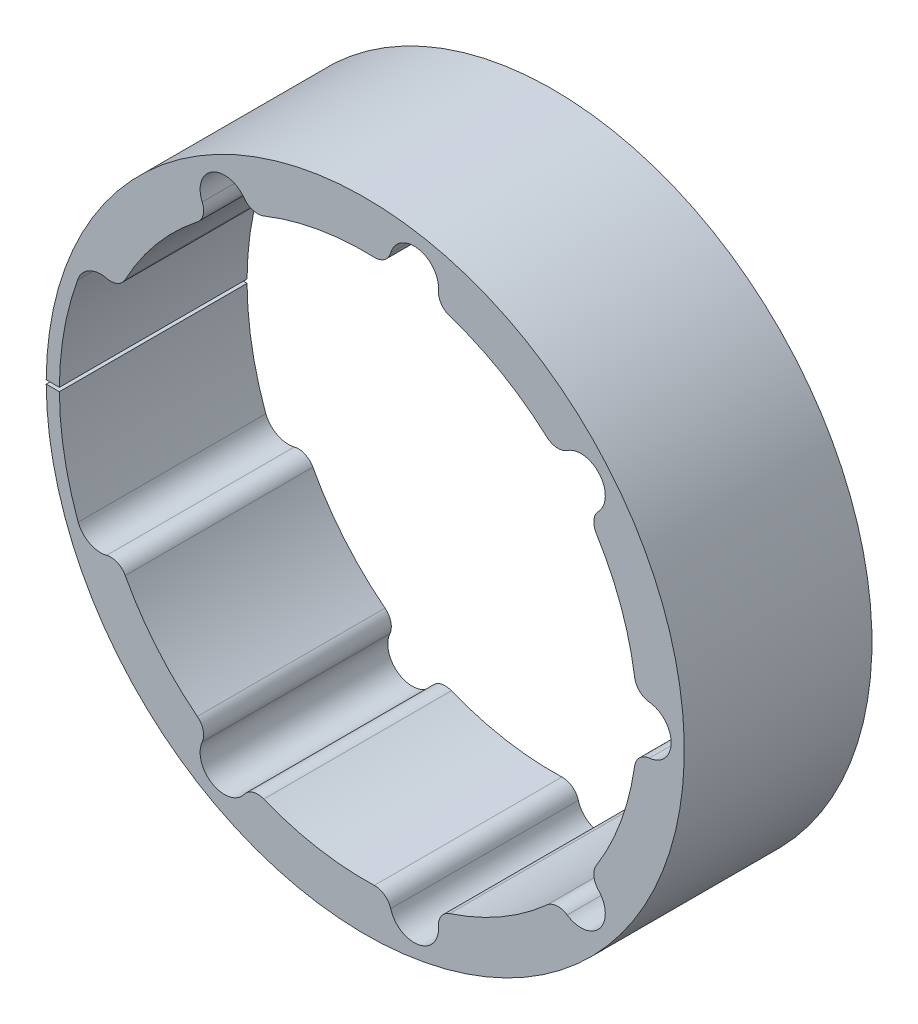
from build123d import *

# Parameters (mm, degrees)
BOSS_EXTRUDE1_DEPTH = 25
FILLET1_R           = 2.2


with BuildPart() as part:
    # Sketch1 → Boss-Extrude1 (new body)
    with BuildSketch(Plane.XY):
        with BuildLine():
            Line((36.104016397, 3.25), (37.5, 3.25))
            ThreePointArc((37.5, 3.25), (40.75, 0), (37.5, -3.25))
            Line((37.5, -3.25), (36.104016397, -3.25))
            ThreePointArc((36.104016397, -3.25), (34.063857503, -12.398230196), (29.746340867, -20.71756996))
            Line((29.746340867, -20.71756996), (30.815726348, -21.614890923))
            ThreePointArc((30.815726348, -21.614890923), (31.216311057, -26.193595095), (26.637606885, -26.594179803))
            Line((26.637606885, -26.594179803), (25.568221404, -25.69685884))
            ThreePointArc((25.568221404, -25.69685884), (18.125, -31.393420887), (9.470021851, -34.991158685))
            Line((9.470021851, -34.991158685), (9.71243186, -36.365934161))
            ThreePointArc((9.71243186, -36.365934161), (7.07616324, -40.130915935), (3.311181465, -37.494647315))
            Line((3.311181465, -37.494647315), (3.068771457, -36.11987184))
            ThreePointArc((3.068771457, -36.11987184), (-6.29474644, -35.699281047), (-15.237425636, -32.891995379))
            Line((-15.237425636, -32.891995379), (-15.935417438, -34.100952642))
            ThreePointArc((-15.935417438, -34.100952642), (-20.375, -35.290535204), (-21.564582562, -30.850952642))
            Line((-21.564582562, -30.850952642), (-20.866590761, -29.641995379))
            ThreePointArc((-20.866590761, -29.641995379), (-27.769111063, -23.301050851), (-32.815112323, -15.40230188))
            Line((-32.815112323, -15.40230188), (-34.126907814, -15.879756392))
            ThreePointArc((-34.126907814, -15.879756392), (-36.554264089, -15.797487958), (-38.246792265, -14.055599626))
            ThreePointArc((-38.246792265, -14.055599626), (-40.095532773, -7.261215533), (-40.746956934, -0.25))
            Line((-40.746956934, -0.25), (-42.4992647, -0.25))
            ThreePointArc((-42.4992647, -0.25), (0.125000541, -42.499816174), (42.5, 0))
            ThreePointArc((42.5, 0), (0.125000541, 42.499816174), (-42.4992647, 0.25))
            Line((-42.4992647, 0.25), (-40.746956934, 0.25))
            ThreePointArc((-40.746956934, 0.25), (-40.117929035, 7.136439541), (-38.333507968, 13.81735019))
            ThreePointArc((-38.333507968, 13.81735019), (-36.669178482, 15.743902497), (-34.126907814, 15.879756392))
            Line((-34.126907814, 15.879756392), (-32.815112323, 15.40230188))
            ThreePointArc((-32.815112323, 15.40230188), (-27.769111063, 23.301050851), (-20.866590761, 29.641995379))
            Line((-20.866590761, 29.641995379), (-21.564582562, 30.850952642))
            ThreePointArc((-21.564582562, 30.850952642), (-20.375, 35.290535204), (-15.935417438, 34.100952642))
            Line((-15.935417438, 34.100952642), (-15.237425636, 32.891995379))
            ThreePointArc((-15.237425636, 32.891995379), (-6.29474644, 35.699281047), (3.068771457, 36.11987184))
            Line((3.068771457, 36.11987184), (3.311181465, 37.494647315))
            ThreePointArc((3.311181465, 37.494647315), (7.07616324, 40.130915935), (9.71243186, 36.365934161))
            Line((9.71243186, 36.365934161), (9.470021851, 34.991158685))
            ThreePointArc((9.470021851, 34.991158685), (18.125, 31.393420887), (25.568221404, 25.69685884))
            Line((25.568221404, 25.69685884), (26.637606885, 26.594179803))
            ThreePointArc((26.637606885, 26.594179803), (31.216311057, 26.193595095), (30.815726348, 21.614890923))
            Line((30.815726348, 21.614890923), (29.746340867, 20.71756996))
            ThreePointArc((29.746340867, 20.71756996), (34.063857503, 12.398230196), (36.104016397, 3.25))
        make_face()
    extrude(amount=BOSS_EXTRUDE1_DEPTH)

    # Fillet1
    fillet1_edges = [part.edges().sort_by_distance(p)[0] for p in [
        (-32.815112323, -15.40230188, 12.5),
        (-20.866590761, -29.641995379, 12.5),
        (-15.237425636, -32.891995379, 12.5),
        (3.068771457, -36.11987184, 12.5),
        (9.470021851, -34.991158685, 12.5),
        (25.568221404, -25.69685884, 12.5),
        (29.746340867, -20.71756996, 12.5),
        (36.104016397, -3.25, 12.5),
        (36.104016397, 3.25, 12.5),
        (29.746340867, 20.71756996, 12.5),
        (25.568221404, 25.69685884, 12.5),
        (9.470021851, 34.991158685, 12.5),
        (3.068771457, 36.11987184, 12.5),
        (-15.237425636, 32.891995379, 12.5),
        (-20.866590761, 29.641995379, 12.5),
        (-32.815112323, 15.40230188, 12.5),
    ]]
    fillet(fillet1_edges, radius=FILLET1_R)


solid = part.part
